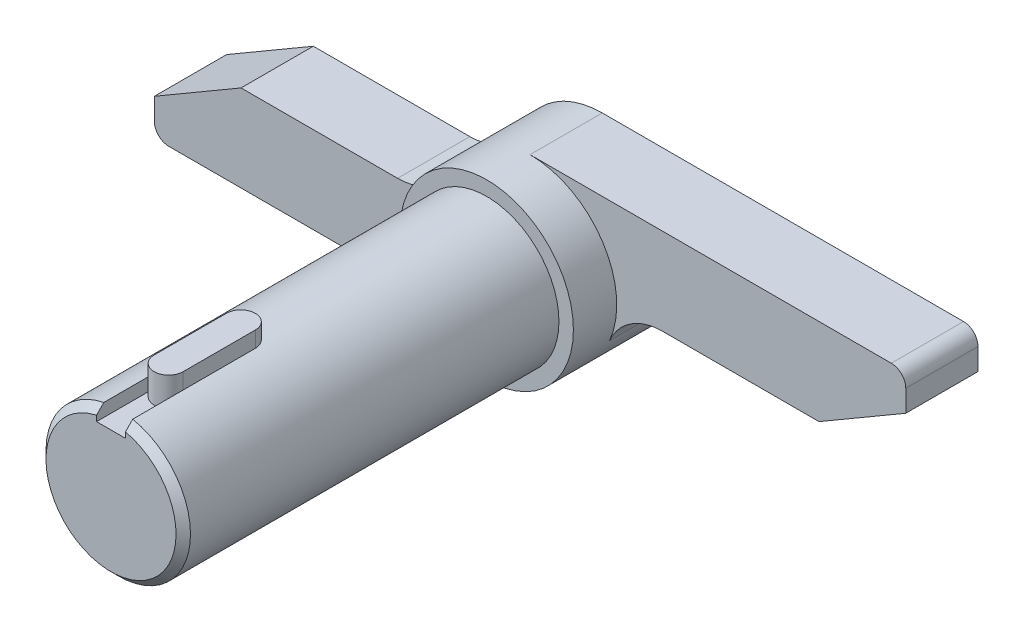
ISO-10303-21;
HEADER;
FILE_DESCRIPTION(('STEP AP214'),'2;1');
FILE_NAME('part.step','',(''),(''),'','','');
FILE_SCHEMA(('AUTOMOTIVE_DESIGN { 1 0 10303 214 1 1 1 1 }'));
ENDSEC;
DATA;
#1=APPLICATION_CONTEXT('core data for automotive mechanical design processes');
#2=APPLICATION_PROTOCOL_DEFINITION('international standard','automotive_design',2000,#1);
#3=PRODUCT_CONTEXT('',#1,'mechanical');
#4=PRODUCT('Part','Part','',(#3));
#5=PRODUCT_RELATED_PRODUCT_CATEGORY('part','',(#4));
#6=PRODUCT_DEFINITION_FORMATION('','',#4);
#7=PRODUCT_DEFINITION_CONTEXT('part definition',#1,'design');
#8=PRODUCT_DEFINITION('design','',#6,#7);
#9=PRODUCT_DEFINITION_SHAPE('','',#8);
#10=(LENGTH_UNIT() NAMED_UNIT(*) SI_UNIT(.MILLI.,.METRE.));
#11=(NAMED_UNIT(*) PLANE_ANGLE_UNIT() SI_UNIT($,.RADIAN.));
#12=(NAMED_UNIT(*) SI_UNIT($,.STERADIAN.) SOLID_ANGLE_UNIT());
#13=UNCERTAINTY_MEASURE_WITH_UNIT(LENGTH_MEASURE(1.E-05),#10,'distance_accuracy_value','');
#14=(GEOMETRIC_REPRESENTATION_CONTEXT(3) GLOBAL_UNCERTAINTY_ASSIGNED_CONTEXT((#13)) GLOBAL_UNIT_ASSIGNED_CONTEXT((#10,
#11,#12)) REPRESENTATION_CONTEXT('',''));
#15=CARTESIAN_POINT('',(0.,0.,0.));
#16=DIRECTION('',(0.,0.,1.));
#17=DIRECTION('',(1.,0.,0.));
#18=AXIS2_PLACEMENT_3D('',#15,#16,#17);
#19=CARTESIAN_POINT('',(1.0013822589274,4.00000000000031,25.));
#20=DIRECTION('',(0.,1.,0.));
#21=DIRECTION('',(-1.,0.,0.));
#22=AXIS2_PLACEMENT_3D('',#19,#20,#21);
#23=PLANE('',#22);
#24=DIRECTION('',(-0.000275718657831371,0.,0.99999996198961));
#25=VECTOR('',#24,1.);
#26=CARTESIAN_POINT('',(1.0013822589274,4.00000000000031,25.));
#27=LINE('',#26,#25);
#28=CARTESIAN_POINT('',(1.0013822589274,4.00000000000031,25.));
#29=VERTEX_POINT('',#28);
#30=CARTESIAN_POINT('',(0.999999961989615,4.00000000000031,30.013432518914));
#31=VERTEX_POINT('',#30);
#32=EDGE_CURVE('E189',#29,#31,#27,.T.);
#33=ORIENTED_EDGE('',*,*,#32,.T.);
#34=CARTESIAN_POINT('',(0.,4.00000000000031,30.0131568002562));
#35=DIRECTION('',(0.,1.,0.));
#36=DIRECTION('',(-1.,0.,0.));
#37=AXIS2_PLACEMENT_3D('',#34,#35,#36);
#38=CIRCLE('',#37,1.);
#39=CARTESIAN_POINT('',(-1.,4.00000000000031,30.0131568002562));
#40=VERTEX_POINT('',#39);
#41=EDGE_CURVE('E201',#40,#31,#38,.T.);
#42=ORIENTED_EDGE('',*,*,#41,.F.);
#43=DIRECTION('',(0.,0.,1.));
#44=VECTOR('',#43,1.);
#45=CARTESIAN_POINT('',(-1.,4.00000000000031,25.));
#46=LINE('',#45,#44);
#47=CARTESIAN_POINT('',(-1.,4.00000000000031,34.));
#48=VERTEX_POINT('',#47);
#49=EDGE_CURVE('E216',#40,#48,#46,.T.);
#50=ORIENTED_EDGE('',*,*,#49,.T.);
#51=DIRECTION('',(-1.,0.,0.));
#52=VECTOR('',#51,1.);
#53=CARTESIAN_POINT('',(1.0013822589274,4.00000000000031,34.));
#54=LINE('',#53,#52);
#55=CARTESIAN_POINT('',(1.0013822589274,4.00000000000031,34.));
#56=VERTEX_POINT('',#55);
#57=EDGE_CURVE('E207',#56,#48,#54,.T.);
#58=ORIENTED_EDGE('',*,*,#57,.F.);
#59=DIRECTION('',(0.,0.,1.));
#60=VECTOR('',#59,1.);
#61=CARTESIAN_POINT('',(1.0013822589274,4.00000000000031,25.));
#62=LINE('',#61,#60);
#63=EDGE_CURVE('E205',#29,#56,#62,.T.);
#64=ORIENTED_EDGE('',*,*,#63,.F.);
#65=EDGE_LOOP('',(#33,#42,#50,#58,#64));
#66=FACE_BOUND('',#65,.T.);
#67=ADVANCED_FACE('F33',(#66),#23,.T.);
#68=CARTESIAN_POINT('',(0.,0.,34.));
#69=DIRECTION('',(0.,0.,-1.));
#70=DIRECTION('',(-1.,0.,0.));
#71=AXIS2_PLACEMENT_3D('',#68,#69,#70);
#72=CYLINDRICAL_SURFACE('',#71,4.99999999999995);
#73=CARTESIAN_POINT('',(0.,0.,8.));
#74=DIRECTION('',(0.,0.,1.));
#75=DIRECTION('',(1.,0.,0.));
#76=AXIS2_PLACEMENT_3D('',#73,#74,#75);
#77=CIRCLE('',#76,4.99999999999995);
#78=CARTESIAN_POINT('',(4.99999999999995,0.,8.));
#79=VERTEX_POINT('',#78);
#80=EDGE_CURVE('E227',#79,#79,#77,.T.);
#81=ORIENTED_EDGE('',*,*,#80,.T.);
#82=EDGE_LOOP('',(#81));
#83=FACE_BOUND('',#82,.T.);
#84=CARTESIAN_POINT('',(1.00002814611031,4.89897374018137,25.007502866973));
#85=CARTESIAN_POINT('',(1.00002609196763,4.89897484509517,24.9519369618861));
#86=CARTESIAN_POINT('',(0.995381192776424,4.89992939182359,24.896345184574));
#87=CARTESIAN_POINT('',(0.976939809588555,4.90363883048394,24.7867342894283));
#88=CARTESIAN_POINT('',(0.96313600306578,4.90639516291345,24.7327164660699));
#89=CARTESIAN_POINT('',(0.926821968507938,4.91338379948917,24.6278551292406));
#90=CARTESIAN_POINT('',(0.904320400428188,4.91761463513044,24.5770085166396));
#91=CARTESIAN_POINT('',(0.851273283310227,4.92707382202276,24.4798135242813));
#92=CARTESIAN_POINT('',(0.820728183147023,4.93230211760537,24.4334648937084));
#93=CARTESIAN_POINT('',(0.75200059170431,4.94324973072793,24.3459236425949));
#94=CARTESIAN_POINT('',(0.713726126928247,4.94897443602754,24.3048038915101));
#95=CARTESIAN_POINT('',(0.630824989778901,4.96022241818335,24.2295237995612));
#96=CARTESIAN_POINT('',(0.586197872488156,4.96574568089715,24.1953639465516));
#97=CARTESIAN_POINT('',(0.491375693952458,4.9760265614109,24.1346905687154));
#98=CARTESIAN_POINT('',(0.441135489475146,4.98077708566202,24.1082462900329));
#99=CARTESIAN_POINT('',(0.336814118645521,4.9889167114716,24.0642015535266));
#100=CARTESIAN_POINT('',(0.282733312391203,4.99230594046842,24.0466002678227));
#101=CARTESIAN_POINT('',(0.173022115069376,4.99730303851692,24.020967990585));
#102=CARTESIAN_POINT('',(0.117421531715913,4.99893379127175,24.0128139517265));
#103=CARTESIAN_POINT('',(0.00561923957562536,5.00030922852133,24.0059237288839));
#104=CARTESIAN_POINT('',(-0.0505824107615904,5.00005409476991,24.007186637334));
#105=CARTESIAN_POINT('',(-0.16114595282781,4.99770423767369,24.0190011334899));
#106=CARTESIAN_POINT('',(-0.215522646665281,4.99563576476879,24.0294201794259));
#107=CARTESIAN_POINT('',(-0.321739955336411,4.98992125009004,24.0590409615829));
#108=CARTESIAN_POINT('',(-0.37358046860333,4.98627514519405,24.0782430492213));
#109=CARTESIAN_POINT('',(-0.473631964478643,4.97777178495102,24.1250076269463));
#110=CARTESIAN_POINT('',(-0.521818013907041,4.97290704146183,24.15262204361));
#111=CARTESIAN_POINT('',(-0.612921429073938,4.96250268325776,24.2153889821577));
#112=CARTESIAN_POINT('',(-0.655838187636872,4.95696299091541,24.2505423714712));
#113=CARTESIAN_POINT('',(-0.735971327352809,4.94570669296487,24.3281164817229));
#114=CARTESIAN_POINT('',(-0.773075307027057,4.93998868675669,24.3706531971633));
#115=CARTESIAN_POINT('',(-0.839641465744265,4.9291118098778,24.4614029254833));
#116=CARTESIAN_POINT('',(-0.869103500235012,4.92395294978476,24.5096160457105));
#117=CARTESIAN_POINT('',(-0.919588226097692,4.9147757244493,24.6105114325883));
#118=CARTESIAN_POINT('',(-0.940592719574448,4.91075982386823,24.6632030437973));
#119=CARTESIAN_POINT('',(-0.97341747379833,4.90435938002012,24.7714664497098));
#120=CARTESIAN_POINT('',(-0.985238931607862,4.90197462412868,24.827037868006));
#121=CARTESIAN_POINT('',(-0.999194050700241,4.89914907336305,24.9384646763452));
#122=CARTESIAN_POINT('',(-1.00149002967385,4.89867571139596,24.9942989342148));
#123=CARTESIAN_POINT('',(-0.996765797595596,4.89963912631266,25.1055526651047));
#124=CARTESIAN_POINT('',(-0.989746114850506,4.90107579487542,25.1609721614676));
#125=CARTESIAN_POINT('',(-0.966729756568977,4.90566689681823,25.2692776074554));
#126=CARTESIAN_POINT('',(-0.950819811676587,4.90880472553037,25.322182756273));
#127=CARTESIAN_POINT('',(-0.910567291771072,4.91643003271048,25.4245765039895));
#128=CARTESIAN_POINT('',(-0.886224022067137,4.9209176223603,25.4740648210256));
#129=CARTESIAN_POINT('',(-0.829428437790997,4.93080997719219,25.5689303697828));
#130=CARTESIAN_POINT('',(-0.796874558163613,4.93622593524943,25.6142456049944));
#131=CARTESIAN_POINT('',(-0.724717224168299,4.94733407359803,25.6988293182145));
#132=CARTESIAN_POINT('',(-0.685113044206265,4.95302628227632,25.7380971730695));
#133=CARTESIAN_POINT('',(-0.599250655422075,4.96415125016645,25.8100868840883));
#134=CARTESIAN_POINT('',(-0.552899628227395,4.96957868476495,25.8426989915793));
#135=CARTESIAN_POINT('',(-0.455282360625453,4.97946996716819,25.8996730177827));
#136=CARTESIAN_POINT('',(-0.40401632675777,4.98393385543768,25.9240352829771));
#137=CARTESIAN_POINT('',(-0.298312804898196,4.99137235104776,25.9636581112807));
#138=CARTESIAN_POINT('',(-0.243895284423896,4.9943553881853,25.9789702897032));
#139=CARTESIAN_POINT('',(-0.133194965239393,4.99853222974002,26.0002218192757));
#140=CARTESIAN_POINT('',(-0.0769123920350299,4.99972624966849,26.006162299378));
#141=CARTESIAN_POINT('',(0.0348720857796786,5.00018542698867,26.0084580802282));
#142=CARTESIAN_POINT('',(0.0903705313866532,4.99948378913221,26.0049783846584));
#143=CARTESIAN_POINT('',(0.199974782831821,4.99630030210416,25.9888969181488));
#144=CARTESIAN_POINT('',(0.254080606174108,4.99381847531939,25.9762952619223));
#145=CARTESIAN_POINT('',(0.359260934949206,4.98735440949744,25.9424009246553));
#146=CARTESIAN_POINT('',(0.410342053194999,4.98337559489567,25.9211280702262));
#147=CARTESIAN_POINT('',(0.508233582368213,4.97434597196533,25.870516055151));
#148=CARTESIAN_POINT('',(0.555043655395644,4.96929507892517,25.8411762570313));
#149=CARTESIAN_POINT('',(0.643880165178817,4.95857389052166,25.7747066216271));
#150=CARTESIAN_POINT('',(0.685817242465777,4.95289491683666,25.7374587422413));
#151=CARTESIAN_POINT('',(0.762902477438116,4.94160917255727,25.6564727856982));
#152=CARTESIAN_POINT('',(0.798049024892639,4.9360024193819,25.6127331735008));
#153=CARTESIAN_POINT('',(0.860915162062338,4.92542942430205,25.5194401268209));
#154=CARTESIAN_POINT('',(0.888550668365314,4.92047073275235,25.4698291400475));
#155=CARTESIAN_POINT('',(0.935049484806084,4.91184753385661,25.3665824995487));
#156=CARTESIAN_POINT('',(0.953920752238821,4.90818185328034,25.3129505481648));
#157=CARTESIAN_POINT('',(0.978696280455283,4.90329139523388,25.217248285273));
#158=CARTESIAN_POINT('',(0.986681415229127,4.90168231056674,25.1757237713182));
#159=CARTESIAN_POINT('',(0.997348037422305,4.89952308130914,25.0919720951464));
#160=CARTESIAN_POINT('',(1.00002970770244,4.89897290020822,25.0497449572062));
#161=CARTESIAN_POINT('',(1.00002814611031,4.89897374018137,25.007502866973));
#162=B_SPLINE_CURVE_WITH_KNOTS('',3,(#84,#85,#86,#87,#88,#89,#90,#91,#92,#93,#94,#95,#96,#97,
#98,#99,#100,#101,#102,#103,#104,#105,#106,#107,#108,#109,#110,#111,#112,#113,#114,#115,#116,
#117,#118,#119,#120,#121,#122,#123,#124,#125,#126,#127,#128,#129,#130,#131,#132,#133,#134,#135,
#136,#137,#138,#139,#140,#141,#142,#143,#144,#145,#146,#147,#148,#149,#150,#151,#152,#153,#154,
#155,#156,#157,#158,#159,#160,#161),.UNSPECIFIED.,.T.,.F.,(4,2,2,2,2,2,2,2,2,2,2,2,2,2,2,2,2,2,
2,2,2,2,2,2,2,2,2,2,2,2,2,2,2,2,2,2,2,2,4),(0.,0.166543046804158,0.333219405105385,
0.499730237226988,0.666231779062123,0.834845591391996,1.00347121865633,1.17356670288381,
1.34364625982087,1.51148475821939,1.67930708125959,1.84473934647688,2.01017823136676,
2.17665975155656,2.34316043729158,2.51256335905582,2.68196948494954,2.85173819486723,
3.02148477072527,3.1883266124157,3.35515899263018,3.52039152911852,3.68563767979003,
3.85303781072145,4.02045517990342,4.19044273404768,4.36042314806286,4.52942451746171,
4.69840552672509,4.86444590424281,5.0304841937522,5.19614494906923,5.36181879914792,
5.53016550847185,5.69855208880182,5.8687525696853,6.03879821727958,6.16541127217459,
6.29201996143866),.UNSPECIFIED.);
#163=CARTESIAN_POINT('',(0.981829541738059,4.90265343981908,24.8175896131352));
#164=VERTEX_POINT('',#163);
#165=CARTESIAN_POINT('',(-1.,4.8989794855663,25.015005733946));
#166=VERTEX_POINT('',#165);
#167=EDGE_CURVE('E452',#164,#166,#162,.T.);
#168=ORIENTED_EDGE('',*,*,#167,.F.);
#169=CARTESIAN_POINT('',(1.00149476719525,4.89867412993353,25.015005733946));
#170=CARTESIAN_POINT('',(1.00149271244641,4.89867523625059,25.0706096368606));
#171=CARTESIAN_POINT('',(0.996844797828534,4.89963185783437,25.1262394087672));
#172=CARTESIAN_POINT('',(0.97839150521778,4.90334940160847,25.2359251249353));
#173=CARTESIAN_POINT('',(0.964578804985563,4.90611176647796,25.2899797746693));
#174=CARTESIAN_POINT('',(0.9282415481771,4.91311585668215,25.3949124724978));
#175=CARTESIAN_POINT('',(0.905725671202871,4.91735610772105,25.4457936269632));
#176=CARTESIAN_POINT('',(0.852645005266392,4.92683672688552,25.5430548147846));
#177=CARTESIAN_POINT('',(0.822080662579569,4.93207703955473,25.5894350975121));
#178=CARTESIAN_POINT('',(0.753308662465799,4.94305073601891,25.6770381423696));
#179=CARTESIAN_POINT('',(0.715008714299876,4.94878954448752,25.7181877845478));
#180=CARTESIAN_POINT('',(0.63205212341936,4.96006644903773,25.7935231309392));
#181=CARTESIAN_POINT('',(0.587395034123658,4.96560453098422,25.8277083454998));
#182=CARTESIAN_POINT('',(0.492506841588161,4.97591507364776,25.888428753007));
#183=CARTESIAN_POINT('',(0.442230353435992,4.98068040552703,25.9148943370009));
#184=CARTESIAN_POINT('',(0.337832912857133,4.98884823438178,25.9589751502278));
#185=CARTESIAN_POINT('',(0.283712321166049,4.99225085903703,25.9765912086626));
#186=CARTESIAN_POINT('',(0.17392047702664,4.99727229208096,26.0022455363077));
#187=CARTESIAN_POINT('',(0.118279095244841,4.99891403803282,26.010407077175));
#188=CARTESIAN_POINT('',(0.00639419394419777,5.00030876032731,26.0173051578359));
#189=CARTESIAN_POINT('',(-0.0498492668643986,5.00006191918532,26.0160426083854));
#190=CARTESIAN_POINT('',(-0.160493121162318,4.99772566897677,26.0042218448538));
#191=CARTESIAN_POINT('',(-0.214908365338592,4.99566262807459,25.9937966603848));
#192=CARTESIAN_POINT('',(-0.321201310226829,4.98995635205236,25.9641574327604));
#193=CARTESIAN_POINT('',(-0.373078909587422,4.98631305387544,25.9449430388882));
#194=CARTESIAN_POINT('',(-0.473201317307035,4.97781309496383,25.8981484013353));
#195=CARTESIAN_POINT('',(-0.521421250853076,4.97294895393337,25.8705163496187));
#196=CARTESIAN_POINT('',(-0.612589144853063,4.9625440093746,25.8077090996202));
#197=CARTESIAN_POINT('',(-0.655536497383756,4.95700312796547,25.7725330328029));
#198=CARTESIAN_POINT('',(-0.735727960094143,4.94574314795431,25.694908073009));
#199=CARTESIAN_POINT('',(-0.772859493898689,4.94002262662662,25.6523429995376));
#200=CARTESIAN_POINT('',(-0.839475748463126,4.92914020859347,25.5615324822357));
#201=CARTESIAN_POINT('',(-0.868960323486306,4.92397832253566,25.5132869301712));
#202=CARTESIAN_POINT('',(-0.919485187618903,4.91479511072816,25.4123221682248));
#203=CARTESIAN_POINT('',(-0.940507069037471,4.91077627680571,25.3595935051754));
#204=CARTESIAN_POINT('',(-0.973360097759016,4.90437081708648,25.2512535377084));
#205=CARTESIAN_POINT('',(-0.985192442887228,4.90198397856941,25.1956426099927));
#206=CARTESIAN_POINT('',(-0.999162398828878,4.89915553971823,25.0841358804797));
#207=CARTESIAN_POINT('',(-1.00146239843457,4.89868135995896,25.0282612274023));
#208=CARTESIAN_POINT('',(-0.996739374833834,4.89964450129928,24.9169266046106));
#209=CARTESIAN_POINT('',(-0.989716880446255,4.90108171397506,24.861466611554));
#210=CARTESIAN_POINT('',(-0.966688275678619,4.90567508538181,24.7530819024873));
#211=CARTESIAN_POINT('',(-0.950769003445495,4.90881461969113,24.700137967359));
#212=CARTESIAN_POINT('',(-0.910491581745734,4.91644410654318,24.5976687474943));
#213=CARTESIAN_POINT('',(-0.886132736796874,4.92093417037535,24.5481437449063));
#214=CARTESIAN_POINT('',(-0.82929991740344,4.93083170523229,24.4532074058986));
#215=CARTESIAN_POINT('',(-0.796724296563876,4.93625037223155,24.4078581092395));
#216=CARTESIAN_POINT('',(-0.724518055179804,4.94736342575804,24.3232103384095));
#217=CARTESIAN_POINT('',(-0.684886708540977,4.95305784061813,24.2839124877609));
#218=CARTESIAN_POINT('',(-0.598965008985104,4.96418598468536,24.2118674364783));
#219=CARTESIAN_POINT('',(-0.5525817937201,4.96961437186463,24.1792300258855));
#220=CARTESIAN_POINT('',(-0.454896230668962,4.97950559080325,24.1222111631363));
#221=CARTESIAN_POINT('',(-0.40359409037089,4.9839684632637,24.0978293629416));
#222=CARTESIAN_POINT('',(-0.297816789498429,4.99140235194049,24.05817435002));
#223=CARTESIAN_POINT('',(-0.243361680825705,4.99438184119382,24.0428493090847));
#224=CARTESIAN_POINT('',(-0.132584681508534,4.99854887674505,24.0215784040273));
#225=CARTESIAN_POINT('',(-0.0762630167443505,4.99973663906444,24.0156314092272));
#226=CARTESIAN_POINT('',(0.0355985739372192,5.00018072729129,24.0133291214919));
#227=CARTESIAN_POINT('',(0.0911350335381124,4.99947032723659,24.0168086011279));
#228=CARTESIAN_POINT('',(0.20081456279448,4.99626703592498,24.0328954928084));
#229=CARTESIAN_POINT('',(0.254957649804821,4.9937741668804,24.0455027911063));
#230=CARTESIAN_POINT('',(0.360211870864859,4.98728622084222,24.0794142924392));
#231=CARTESIAN_POINT('',(0.41132956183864,4.98329454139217,24.1006988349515));
#232=CARTESIAN_POINT('',(0.509291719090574,4.97423810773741,24.1513396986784));
#233=CARTESIAN_POINT('',(0.556135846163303,4.96917326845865,24.1806966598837));
#234=CARTESIAN_POINT('',(0.645039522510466,4.95842353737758,24.247207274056));
#235=CARTESIAN_POINT('',(0.687009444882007,4.952729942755,24.2844793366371));
#236=CARTESIAN_POINT('',(0.764155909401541,4.94141575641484,24.3655189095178));
#237=CARTESIAN_POINT('',(0.799330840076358,4.93579518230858,24.4092879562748));
#238=CARTESIAN_POINT('',(0.862249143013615,4.92519625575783,24.5026453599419));
#239=CARTESIAN_POINT('',(0.889908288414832,4.92022548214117,24.5522913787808));
#240=CARTESIAN_POINT('',(0.936448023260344,4.91158120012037,24.6556120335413));
#241=CARTESIAN_POINT('',(0.955336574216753,4.90790651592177,24.7092829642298));
#242=CARTESIAN_POINT('',(0.980138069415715,4.90300342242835,24.8050633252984));
#243=CARTESIAN_POINT('',(0.988132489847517,4.90139000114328,24.8466266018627));
#244=CARTESIAN_POINT('',(0.998811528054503,4.89922495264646,24.9304568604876));
#245=CARTESIAN_POINT('',(1.00149632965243,4.89867328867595,24.9727238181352));
#246=CARTESIAN_POINT('',(1.00149476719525,4.89867412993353,25.015005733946));
#247=B_SPLINE_CURVE_WITH_KNOTS('',3,(#169,#170,#171,#172,#173,#174,#175,#176,#177,#178,#179,
#180,#181,#182,#183,#184,#185,#186,#187,#188,#189,#190,#191,#192,#193,#194,#195,#196,#197,#198,
#199,#200,#201,#202,#203,#204,#205,#206,#207,#208,#209,#210,#211,#212,#213,#214,#215,#216,#217,
#218,#219,#220,#221,#222,#223,#224,#225,#226,#227,#228,#229,#230,#231,#232,#233,#234,#235,#236,
#237,#238,#239,#240,#241,#242,#243,#244,#245,#246),.UNSPECIFIED.,.T.,.F.,(4,2,2,2,2,2,2,2,2,2,2,
2,2,2,2,2,2,2,2,2,2,2,2,2,2,2,2,2,2,2,2,2,2,2,2,2,2,2,4),(0.,0.166656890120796,
0.333447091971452,0.500071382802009,0.666686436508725,0.835421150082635,1.00416772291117,
1.17439193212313,1.34460018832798,1.51256329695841,1.68051017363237,1.84605822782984,
2.01161288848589,2.17820780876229,2.34482191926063,2.51434291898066,2.68386714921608,
2.85375815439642,3.02362701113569,3.19058985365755,3.35754322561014,3.52289479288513,
3.68825998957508,3.85578082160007,4.02331890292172,4.19342822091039,4.36353036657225,
4.53264941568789,4.70174807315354,4.86790202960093,5.03405391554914,5.19983141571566,
5.36562206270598,5.53409386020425,5.70260556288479,5.87293437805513,6.04310827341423,
6.16984068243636,6.29656870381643),.UNSPECIFIED.);
#248=CARTESIAN_POINT('',(1.0013822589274,4.89869713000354,25.));
#249=VERTEX_POINT('',#248);
#250=EDGE_CURVE('E453',#164,#249,#247,.T.);
#251=ORIENTED_EDGE('',*,*,#250,.T.);
#252=DIRECTION('',(0.,0.,-1.));
#253=VECTOR('',#252,1.);
#254=CARTESIAN_POINT('',(1.0013822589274,4.89869713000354,34.));
#255=LINE('',#254,#253);
#256=CARTESIAN_POINT('',(1.0013822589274,4.89869713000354,33.5));
#257=VERTEX_POINT('',#256);
#258=EDGE_CURVE('E210',#249,#257,#255,.F.);
#259=ORIENTED_EDGE('',*,*,#258,.T.);
#260=CARTESIAN_POINT('',(0.,0.,33.5));
#261=DIRECTION('',(0.,0.,1.));
#262=DIRECTION('',(1.,0.,0.));
#263=AXIS2_PLACEMENT_3D('',#260,#261,#262);
#264=CIRCLE('',#263,4.99999999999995);
#265=CARTESIAN_POINT('',(-1.,4.8989794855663,33.5));
#266=VERTEX_POINT('',#265);
#267=EDGE_CURVE('E747',#257,#266,#264,.F.);
#268=ORIENTED_EDGE('',*,*,#267,.T.);
#269=DIRECTION('',(0.,0.,-1.));
#270=VECTOR('',#269,1.);
#271=CARTESIAN_POINT('',(-1.,4.8989794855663,34.));
#272=LINE('',#271,#270);
#273=CARTESIAN_POINT('',(-1.,4.8989794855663,30.0131568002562));
#274=VERTEX_POINT('',#273);
#275=EDGE_CURVE('E224',#266,#274,#272,.T.);
#276=ORIENTED_EDGE('',*,*,#275,.T.);
#277=DIRECTION('',(0.,0.,-1.));
#278=VECTOR('',#277,1.);
#279=CARTESIAN_POINT('',(-1.,4.8989794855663,34.));
#280=LINE('',#279,#278);
#281=EDGE_CURVE('E498',#166,#274,#280,.F.);
#282=ORIENTED_EDGE('',*,*,#281,.F.);
#283=EDGE_LOOP('',(#168,#251,#259,#268,#276,#282));
#284=FACE_BOUND('',#283,.T.);
#285=ADVANCED_FACE('F418',(#83,#284),#72,.T.);
#286=CARTESIAN_POINT('',(-1.,5.5,25.));
#287=DIRECTION('',(-1.,0.,0.));
#288=DIRECTION('',(0.,-1.,0.));
#289=AXIS2_PLACEMENT_3D('',#286,#287,#288);
#290=PLANE('',#289);
#291=ORIENTED_EDGE('',*,*,#49,.F.);
#292=DIRECTION('',(0.,-1.,0.));
#293=VECTOR('',#292,1.);
#294=CARTESIAN_POINT('',(-1.,6.00000000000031,30.0131568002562));
#295=LINE('',#294,#293);
#296=EDGE_CURVE('E479',#274,#40,#295,.T.);
#297=ORIENTED_EDGE('',*,*,#296,.F.);
#298=ORIENTED_EDGE('',*,*,#275,.F.);
#299=CARTESIAN_POINT('',(-1.,6.02791771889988,32.3896978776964));
#300=CARTESIAN_POINT('',(-1.,5.89619229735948,32.5196463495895));
#301=CARTESIAN_POINT('',(-1.,5.7644111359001,32.6495382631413));
#302=CARTESIAN_POINT('',(-1.,5.50070865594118,32.9091801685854));
#303=CARTESIAN_POINT('',(-1.,5.36878733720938,33.0389301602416));
#304=CARTESIAN_POINT('',(-1.,4.97277751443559,33.4279167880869));
#305=CARTESIAN_POINT('',(-1.,4.70843643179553,33.6868967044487));
#306=CARTESIAN_POINT('',(-1.,4.31110288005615,34.0745310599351));
#307=CARTESIAN_POINT('',(-1.,4.17851967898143,34.2036048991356));
#308=CARTESIAN_POINT('',(-1.,3.91298964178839,34.4613772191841));
#309=CARTESIAN_POINT('',(-1.,3.78004280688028,34.5900757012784));
#310=CARTESIAN_POINT('',(-1.,3.51366435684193,34.846977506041));
#311=CARTESIAN_POINT('',(-1.,3.38023272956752,34.9751808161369));
#312=CARTESIAN_POINT('',(-1.,3.11267443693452,35.2308627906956));
#313=CARTESIAN_POINT('',(-1.,2.97854776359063,35.3583414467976));
#314=CARTESIAN_POINT('',(-1.,2.8439683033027,35.4853431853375));
#315=B_SPLINE_CURVE_WITH_KNOTS('',3,(#299,#300,#301,#302,#303,#304,#305,#306,#307,#308,#309,
#310,#311,#312,#313,#314),.UNSPECIFIED.,.F.,.F.,(4,2,2,2,2,2,2,4),(0.,0.555106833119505,
1.11021458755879,2.22040179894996,2.77550956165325,3.33061547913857,3.88573539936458,
4.44086171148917),.UNSPECIFIED.);
#316=CARTESIAN_POINT('',(-1.,4.387482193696,34.));
#317=VERTEX_POINT('',#316);
#318=EDGE_CURVE('E454',#266,#317,#315,.T.);
#319=ORIENTED_EDGE('',*,*,#318,.T.);
#320=DIRECTION('',(0.,-1.,0.));
#321=VECTOR('',#320,1.);
#322=CARTESIAN_POINT('',(-1.,5.5,34.));
#323=LINE('',#322,#321);
#324=EDGE_CURVE('E481',#317,#48,#323,.T.);
#325=ORIENTED_EDGE('',*,*,#324,.T.);
#326=EDGE_LOOP('',(#291,#297,#298,#319,#325));
#327=FACE_BOUND('',#326,.T.);
#328=ADVANCED_FACE('F424',(#327),#290,.F.);
#329=CARTESIAN_POINT('',(0.,0.,8.));
#330=DIRECTION('',(0.,0.,1.));
#331=DIRECTION('',(1.,0.,0.));
#332=AXIS2_PLACEMENT_3D('',#329,#330,#331);
#333=PLANE('',#332);
#334=CARTESIAN_POINT('',(0.,0.,8.));
#335=DIRECTION('',(0.,0.,1.));
#336=DIRECTION('',(1.,0.,0.));
#337=AXIS2_PLACEMENT_3D('',#334,#335,#336);
#338=CIRCLE('',#337,6.);
#339=CARTESIAN_POINT('',(6.,0.,8.));
#340=VERTEX_POINT('',#339);
#341=EDGE_CURVE('E231',#340,#340,#338,.T.);
#342=ORIENTED_EDGE('',*,*,#341,.T.);
#343=EDGE_LOOP('',(#342));
#344=FACE_BOUND('',#343,.T.);
#345=ORIENTED_EDGE('',*,*,#80,.F.);
#346=EDGE_LOOP('',(#345));
#347=FACE_BOUND('',#346,.T.);
#348=ADVANCED_FACE('F469',(#344,#347),#333,.T.);
#349=CARTESIAN_POINT('',(0.,0.,5.));
#350=DIRECTION('',(0.,0.,1.));
#351=DIRECTION('',(1.,0.,0.));
#352=AXIS2_PLACEMENT_3D('',#349,#350,#351);
#353=PLANE('',#352);
#354=DIRECTION('',(0.,-1.,0.));
#355=VECTOR('',#354,1.);
#356=CARTESIAN_POINT('',(26.,6.,5.));
#357=LINE('',#356,#355);
#358=CARTESIAN_POINT('',(26.,5.,5.));
#359=VERTEX_POINT('',#358);
#360=CARTESIAN_POINT('',(26.,3.5,5.));
#361=VERTEX_POINT('',#360);
#362=EDGE_CURVE('E297',#359,#361,#357,.T.);
#363=ORIENTED_EDGE('',*,*,#362,.F.);
#364=CARTESIAN_POINT('',(25.,5.,5.));
#365=DIRECTION('',(0.,0.,1.));
#366=DIRECTION('',(1.,0.,0.));
#367=AXIS2_PLACEMENT_3D('',#364,#365,#366);
#368=CIRCLE('',#367,1.);
#369=CARTESIAN_POINT('',(25.,6.,5.));
#370=VERTEX_POINT('',#369);
#371=EDGE_CURVE('E306',#359,#370,#368,.T.);
#372=ORIENTED_EDGE('',*,*,#371,.T.);
#373=DIRECTION('',(-1.,0.,0.));
#374=VECTOR('',#373,1.);
#375=CARTESIAN_POINT('',(26.,6.,5.));
#376=LINE('',#375,#374);
#377=CARTESIAN_POINT('',(0.,6.,5.));
#378=VERTEX_POINT('',#377);
#379=EDGE_CURVE('E269',#370,#378,#376,.T.);
#380=ORIENTED_EDGE('',*,*,#379,.T.);
#381=CARTESIAN_POINT('',(0.,0.,5.));
#382=DIRECTION('',(0.,0.,1.));
#383=DIRECTION('',(1.,0.,0.));
#384=AXIS2_PLACEMENT_3D('',#381,#382,#383);
#385=CIRCLE('',#384,6.);
#386=CARTESIAN_POINT('',(5.49909083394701,-2.4,5.));
#387=VERTEX_POINT('',#386);
#388=EDGE_CURVE('E230',#387,#378,#385,.T.);
#389=ORIENTED_EDGE('',*,*,#388,.F.);
#390=CARTESIAN_POINT('',(9.16515138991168,-4.,5.));
#391=DIRECTION('',(0.,0.,1.));
#392=DIRECTION('',(1.,0.,0.));
#393=AXIS2_PLACEMENT_3D('',#390,#391,#392);
#394=CIRCLE('',#393,4.);
#395=CARTESIAN_POINT('',(9.16515138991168,0.,5.));
#396=VERTEX_POINT('',#395);
#397=EDGE_CURVE('E293',#387,#396,#394,.F.);
#398=ORIENTED_EDGE('',*,*,#397,.T.);
#399=DIRECTION('',(1.,0.,0.));
#400=VECTOR('',#399,1.);
#401=CARTESIAN_POINT('',(6.,0.,5.));
#402=LINE('',#401,#400);
#403=CARTESIAN_POINT('',(20.,0.,5.));
#404=VERTEX_POINT('',#403);
#405=EDGE_CURVE('E258',#396,#404,#402,.T.);
#406=ORIENTED_EDGE('',*,*,#405,.T.);
#407=DIRECTION('',(0.863778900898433,0.503871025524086,0.));
#408=VECTOR('',#407,1.);
#409=CARTESIAN_POINT('',(20.,0.,5.));
#410=LINE('',#409,#408);
#411=EDGE_CURVE('E284',#404,#361,#410,.T.);
#412=ORIENTED_EDGE('',*,*,#411,.T.);
#413=EDGE_LOOP('',(#363,#372,#380,#389,#398,#406,#412));
#414=FACE_BOUND('',#413,.T.);
#415=ADVANCED_FACE('F383',(#414),#353,.T.);
#416=CARTESIAN_POINT('',(-26.,-6.,5.));
#417=DIRECTION('',(-1.,0.,0.));
#418=DIRECTION('',(0.,-1.,0.));
#419=AXIS2_PLACEMENT_3D('',#416,#417,#418);
#420=PLANE('',#419);
#421=DIRECTION('',(0.,1.,0.));
#422=VECTOR('',#421,1.);
#423=CARTESIAN_POINT('',(-26.,-6.,0.));
#424=LINE('',#423,#422);
#425=CARTESIAN_POINT('',(-26.,-5.,0.));
#426=VERTEX_POINT('',#425);
#427=CARTESIAN_POINT('',(-26.,-3.5,0.));
#428=VERTEX_POINT('',#427);
#429=EDGE_CURVE('E234',#426,#428,#424,.T.);
#430=ORIENTED_EDGE('',*,*,#429,.F.);
#431=DIRECTION('',(0.,0.,-1.));
#432=VECTOR('',#431,1.);
#433=CARTESIAN_POINT('',(-26.,-5.,5.));
#434=LINE('',#433,#432);
#435=CARTESIAN_POINT('',(-26.,-5.,5.));
#436=VERTEX_POINT('',#435);
#437=EDGE_CURVE('E41',#426,#436,#434,.F.);
#438=ORIENTED_EDGE('',*,*,#437,.T.);
#439=DIRECTION('',(0.,1.,0.));
#440=VECTOR('',#439,1.);
#441=CARTESIAN_POINT('',(-26.,-6.,5.));
#442=LINE('',#441,#440);
#443=CARTESIAN_POINT('',(-26.,-3.5,5.));
#444=VERTEX_POINT('',#443);
#445=EDGE_CURVE('E323',#436,#444,#442,.T.);
#446=ORIENTED_EDGE('',*,*,#445,.T.);
#447=DIRECTION('',(0.,0.,-1.));
#448=VECTOR('',#447,1.);
#449=CARTESIAN_POINT('',(-26.,-3.5,5.));
#450=LINE('',#449,#448);
#451=EDGE_CURVE('E242',#444,#428,#450,.T.);
#452=ORIENTED_EDGE('',*,*,#451,.T.);
#453=EDGE_LOOP('',(#430,#438,#446,#452));
#454=FACE_BOUND('',#453,.T.);
#455=ADVANCED_FACE('F35',(#454),#420,.T.);
#456=CARTESIAN_POINT('',(0.,-6.,5.));
#457=DIRECTION('',(0.,-1.,0.));
#458=DIRECTION('',(1.,0.,0.));
#459=AXIS2_PLACEMENT_3D('',#456,#457,#458);
#460=PLANE('',#459);
#461=DIRECTION('',(-1.,0.,0.));
#462=VECTOR('',#461,1.);
#463=CARTESIAN_POINT('',(0.,-6.,5.));
#464=LINE('',#463,#462);
#465=CARTESIAN_POINT('',(0.,-6.,5.));
#466=VERTEX_POINT('',#465);
#467=CARTESIAN_POINT('',(-25.,-6.,5.));
#468=VERTEX_POINT('',#467);
#469=EDGE_CURVE('E256',#466,#468,#464,.T.);
#470=ORIENTED_EDGE('',*,*,#469,.T.);
#471=DIRECTION('',(0.,0.,-1.));
#472=VECTOR('',#471,1.);
#473=CARTESIAN_POINT('',(-25.,-6.,5.));
#474=LINE('',#473,#472);
#475=CARTESIAN_POINT('',(-25.,-6.,0.));
#476=VERTEX_POINT('',#475);
#477=EDGE_CURVE('E308',#468,#476,#474,.T.);
#478=ORIENTED_EDGE('',*,*,#477,.T.);
#479=DIRECTION('',(-1.,0.,0.));
#480=VECTOR('',#479,1.);
#481=CARTESIAN_POINT('',(0.,-6.,0.));
#482=LINE('',#481,#480);
#483=CARTESIAN_POINT('',(0.,-6.,0.));
#484=VERTEX_POINT('',#483);
#485=EDGE_CURVE('E315',#484,#476,#482,.T.);
#486=ORIENTED_EDGE('',*,*,#485,.F.);
#487=DIRECTION('',(0.,0.,-1.));
#488=VECTOR('',#487,1.);
#489=CARTESIAN_POINT('',(0.,-6.,5.));
#490=LINE('',#489,#488);
#491=EDGE_CURVE('E251',#466,#484,#490,.T.);
#492=ORIENTED_EDGE('',*,*,#491,.F.);
#493=EDGE_LOOP('',(#470,#478,#486,#492));
#494=FACE_BOUND('',#493,.T.);
#495=ADVANCED_FACE('F314',(#494),#460,.T.);
#496=CARTESIAN_POINT('',(0.,0.,5.));
#497=DIRECTION('',(0.,0.,-1.));
#498=DIRECTION('',(-1.,0.,0.));
#499=AXIS2_PLACEMENT_3D('',#496,#497,#498);
#500=CYLINDRICAL_SURFACE('',#499,6.);
#501=CARTESIAN_POINT('',(0.,0.,0.));
#502=DIRECTION('',(0.,0.,1.));
#503=DIRECTION('',(1.,0.,0.));
#504=AXIS2_PLACEMENT_3D('',#501,#502,#503);
#505=CIRCLE('',#504,6.);
#506=CARTESIAN_POINT('',(0.,6.,0.));
#507=VERTEX_POINT('',#506);
#508=CARTESIAN_POINT('',(-5.49909083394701,2.4,0.));
#509=VERTEX_POINT('',#508);
#510=EDGE_CURVE('E354',#507,#509,#505,.T.);
#511=ORIENTED_EDGE('',*,*,#510,.T.);
#512=DIRECTION('',(0.,0.,-1.));
#513=VECTOR('',#512,1.);
#514=CARTESIAN_POINT('',(-5.49909083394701,2.4,5.));
#515=LINE('',#514,#513);
#516=CARTESIAN_POINT('',(-5.49909083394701,2.4,5.));
#517=VERTEX_POINT('',#516);
#518=EDGE_CURVE('E279',#509,#517,#515,.F.);
#519=ORIENTED_EDGE('',*,*,#518,.T.);
#520=EDGE_CURVE('E247',#517,#466,#385,.T.);
#521=ORIENTED_EDGE('',*,*,#520,.T.);
#522=ORIENTED_EDGE('',*,*,#491,.T.);
#523=CARTESIAN_POINT('',(0.,0.,0.));
#524=DIRECTION('',(0.,0.,1.));
#525=DIRECTION('',(1.,0.,0.));
#526=AXIS2_PLACEMENT_3D('',#523,#524,#525);
#527=CIRCLE('',#526,6.);
#528=CARTESIAN_POINT('',(5.49909083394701,-2.4,0.));
#529=VERTEX_POINT('',#528);
#530=EDGE_CURVE('E322',#484,#529,#527,.T.);
#531=ORIENTED_EDGE('',*,*,#530,.T.);
#532=DIRECTION('',(0.,0.,-1.));
#533=VECTOR('',#532,1.);
#534=CARTESIAN_POINT('',(5.49909083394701,-2.4,5.));
#535=LINE('',#534,#533);
#536=EDGE_CURVE('E276',#529,#387,#535,.F.);
#537=ORIENTED_EDGE('',*,*,#536,.T.);
#538=ORIENTED_EDGE('',*,*,#388,.T.);
#539=DIRECTION('',(0.,0.,-1.));
#540=VECTOR('',#539,1.);
#541=CARTESIAN_POINT('',(0.,6.,5.));
#542=LINE('',#541,#540);
#543=EDGE_CURVE('E339',#378,#507,#542,.T.);
#544=ORIENTED_EDGE('',*,*,#543,.T.);
#545=EDGE_LOOP('',(#511,#519,#521,#522,#531,#537,#538,#544));
#546=FACE_BOUND('',#545,.T.);
#547=ORIENTED_EDGE('',*,*,#341,.F.);
#548=EDGE_LOOP('',(#547));
#549=FACE_BOUND('',#548,.T.);
#550=ADVANCED_FACE('F389',(#546,#549),#500,.T.);
#551=CARTESIAN_POINT('',(6.,0.,5.));
#552=DIRECTION('',(0.,1.,0.));
#553=DIRECTION('',(0.,0.,1.));
#554=AXIS2_PLACEMENT_3D('',#551,#552,#553);
#555=PLANE('',#554);
#556=ORIENTED_EDGE('',*,*,#405,.F.);
#557=DIRECTION('',(0.,0.,1.));
#558=VECTOR('',#557,1.);
#559=CARTESIAN_POINT('',(9.16515138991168,0.,0.));
#560=LINE('',#559,#558);
#561=CARTESIAN_POINT('',(9.16515138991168,0.,0.));
#562=VERTEX_POINT('',#561);
#563=EDGE_CURVE('E282',#396,#562,#560,.F.);
#564=ORIENTED_EDGE('',*,*,#563,.T.);
#565=DIRECTION('',(1.,0.,0.));
#566=VECTOR('',#565,1.);
#567=CARTESIAN_POINT('',(6.,0.,0.));
#568=LINE('',#567,#566);
#569=CARTESIAN_POINT('',(20.,0.,0.));
#570=VERTEX_POINT('',#569);
#571=EDGE_CURVE('E326',#562,#570,#568,.T.);
#572=ORIENTED_EDGE('',*,*,#571,.T.);
#573=DIRECTION('',(0.,0.,-1.));
#574=VECTOR('',#573,1.);
#575=CARTESIAN_POINT('',(20.,0.,5.));
#576=LINE('',#575,#574);
#577=EDGE_CURVE('E253',#404,#570,#576,.T.);
#578=ORIENTED_EDGE('',*,*,#577,.F.);
#579=EDGE_LOOP('',(#556,#564,#572,#578));
#580=FACE_BOUND('',#579,.T.);
#581=ADVANCED_FACE('F369',(#580),#555,.F.);
#582=CARTESIAN_POINT('',(20.,0.,5.));
#583=DIRECTION('',(-0.503871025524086,0.863778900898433,0.));
#584=DIRECTION('',(-0.863778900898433,-0.503871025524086,0.));
#585=AXIS2_PLACEMENT_3D('',#582,#583,#584);
#586=PLANE('',#585);
#587=DIRECTION('',(0.863778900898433,0.503871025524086,0.));
#588=VECTOR('',#587,1.);
#589=CARTESIAN_POINT('',(20.,0.,0.));
#590=LINE('',#589,#588);
#591=CARTESIAN_POINT('',(26.,3.5,0.));
#592=VERTEX_POINT('',#591);
#593=EDGE_CURVE('E363',#570,#592,#590,.T.);
#594=ORIENTED_EDGE('',*,*,#593,.T.);
#595=DIRECTION('',(0.,0.,-1.));
#596=VECTOR('',#595,1.);
#597=CARTESIAN_POINT('',(26.,3.5,5.));
#598=LINE('',#597,#596);
#599=EDGE_CURVE('E337',#361,#592,#598,.T.);
#600=ORIENTED_EDGE('',*,*,#599,.F.);
#601=ORIENTED_EDGE('',*,*,#411,.F.);
#602=ORIENTED_EDGE('',*,*,#577,.T.);
#603=EDGE_LOOP('',(#594,#600,#601,#602));
#604=FACE_BOUND('',#603,.T.);
#605=ADVANCED_FACE('F374',(#604),#586,.F.);
#606=CARTESIAN_POINT('',(26.,6.,5.));
#607=DIRECTION('',(1.,0.,0.));
#608=DIRECTION('',(0.,1.,0.));
#609=AXIS2_PLACEMENT_3D('',#606,#607,#608);
#610=PLANE('',#609);
#611=DIRECTION('',(0.,-1.,0.));
#612=VECTOR('',#611,1.);
#613=CARTESIAN_POINT('',(26.,6.,0.));
#614=LINE('',#613,#612);
#615=CARTESIAN_POINT('',(26.,5.,0.));
#616=VERTEX_POINT('',#615);
#617=EDGE_CURVE('E361',#616,#592,#614,.T.);
#618=ORIENTED_EDGE('',*,*,#617,.F.);
#619=DIRECTION('',(0.,0.,-1.));
#620=VECTOR('',#619,1.);
#621=CARTESIAN_POINT('',(26.,5.,5.));
#622=LINE('',#621,#620);
#623=EDGE_CURVE('E304',#616,#359,#622,.F.);
#624=ORIENTED_EDGE('',*,*,#623,.T.);
#625=ORIENTED_EDGE('',*,*,#362,.T.);
#626=ORIENTED_EDGE('',*,*,#599,.T.);
#627=EDGE_LOOP('',(#618,#624,#625,#626));
#628=FACE_BOUND('',#627,.T.);
#629=ADVANCED_FACE('F379',(#628),#610,.T.);
#630=CARTESIAN_POINT('',(26.,6.,5.));
#631=DIRECTION('',(0.,-1.,0.));
#632=DIRECTION('',(1.,0.,0.));
#633=AXIS2_PLACEMENT_3D('',#630,#631,#632);
#634=PLANE('',#633);
#635=ORIENTED_EDGE('',*,*,#379,.F.);
#636=DIRECTION('',(0.,0.,-1.));
#637=VECTOR('',#636,1.);
#638=CARTESIAN_POINT('',(25.,6.,0.));
#639=LINE('',#638,#637);
#640=CARTESIAN_POINT('',(25.,6.,0.));
#641=VERTEX_POINT('',#640);
#642=EDGE_CURVE('E295',#370,#641,#639,.T.);
#643=ORIENTED_EDGE('',*,*,#642,.T.);
#644=DIRECTION('',(-1.,0.,0.));
#645=VECTOR('',#644,1.);
#646=CARTESIAN_POINT('',(26.,6.,0.));
#647=LINE('',#646,#645);
#648=EDGE_CURVE('E359',#641,#507,#647,.T.);
#649=ORIENTED_EDGE('',*,*,#648,.T.);
#650=ORIENTED_EDGE('',*,*,#543,.F.);
#651=EDGE_LOOP('',(#635,#643,#649,#650));
#652=FACE_BOUND('',#651,.T.);
#653=ADVANCED_FACE('F404',(#652),#634,.F.);
#654=CARTESIAN_POINT('',(-6.,0.,5.));
#655=DIRECTION('',(0.,-1.,0.));
#656=DIRECTION('',(0.,0.,-1.));
#657=AXIS2_PLACEMENT_3D('',#654,#655,#656);
#658=PLANE('',#657);
#659=DIRECTION('',(-1.,0.,0.));
#660=VECTOR('',#659,1.);
#661=CARTESIAN_POINT('',(-6.,0.,5.));
#662=LINE('',#661,#660);
#663=CARTESIAN_POINT('',(-9.16515138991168,0.,5.));
#664=VERTEX_POINT('',#663);
#665=CARTESIAN_POINT('',(-20.,0.,5.));
#666=VERTEX_POINT('',#665);
#667=EDGE_CURVE('E266',#664,#666,#662,.T.);
#668=ORIENTED_EDGE('',*,*,#667,.F.);
#669=DIRECTION('',(0.,0.,1.));
#670=VECTOR('',#669,1.);
#671=CARTESIAN_POINT('',(-9.16515138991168,0.,0.));
#672=LINE('',#671,#670);
#673=CARTESIAN_POINT('',(-9.16515138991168,0.,0.));
#674=VERTEX_POINT('',#673);
#675=EDGE_CURVE('E273',#664,#674,#672,.F.);
#676=ORIENTED_EDGE('',*,*,#675,.T.);
#677=DIRECTION('',(-1.,0.,0.));
#678=VECTOR('',#677,1.);
#679=CARTESIAN_POINT('',(-6.,0.,0.));
#680=LINE('',#679,#678);
#681=CARTESIAN_POINT('',(-20.,0.,0.));
#682=VERTEX_POINT('',#681);
#683=EDGE_CURVE('E353',#674,#682,#680,.T.);
#684=ORIENTED_EDGE('',*,*,#683,.T.);
#685=DIRECTION('',(0.,0.,-1.));
#686=VECTOR('',#685,1.);
#687=CARTESIAN_POINT('',(-20.,0.,5.));
#688=LINE('',#687,#686);
#689=EDGE_CURVE('E340',#666,#682,#688,.T.);
#690=ORIENTED_EDGE('',*,*,#689,.F.);
#691=EDGE_LOOP('',(#668,#676,#684,#690));
#692=FACE_BOUND('',#691,.T.);
#693=ADVANCED_FACE('F400',(#692),#658,.F.);
#694=CARTESIAN_POINT('',(-20.,0.,5.));
#695=DIRECTION('',(0.503871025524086,-0.863778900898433,0.));
#696=DIRECTION('',(0.863778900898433,0.503871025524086,0.));
#697=AXIS2_PLACEMENT_3D('',#694,#695,#696);
#698=PLANE('',#697);
#699=DIRECTION('',(-0.863778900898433,-0.503871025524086,0.));
#700=VECTOR('',#699,1.);
#701=CARTESIAN_POINT('',(-20.,0.,0.));
#702=LINE('',#701,#700);
#703=EDGE_CURVE('E350',#682,#428,#702,.T.);
#704=ORIENTED_EDGE('',*,*,#703,.T.);
#705=ORIENTED_EDGE('',*,*,#451,.F.);
#706=DIRECTION('',(-0.863778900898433,-0.503871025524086,0.));
#707=VECTOR('',#706,1.);
#708=CARTESIAN_POINT('',(-20.,0.,5.));
#709=LINE('',#708,#707);
#710=EDGE_CURVE('E270',#666,#444,#709,.T.);
#711=ORIENTED_EDGE('',*,*,#710,.F.);
#712=ORIENTED_EDGE('',*,*,#689,.T.);
#713=EDGE_LOOP('',(#704,#705,#711,#712));
#714=FACE_BOUND('',#713,.T.);
#715=ADVANCED_FACE('F351',(#714),#698,.F.);
#716=ORIENTED_EDGE('',*,*,#445,.F.);
#717=CARTESIAN_POINT('',(-25.,-5.,5.));
#718=DIRECTION('',(0.,0.,1.));
#719=DIRECTION('',(1.,0.,0.));
#720=AXIS2_PLACEMENT_3D('',#717,#718,#719);
#721=CIRCLE('',#720,1.);
#722=EDGE_CURVE('E11',#436,#468,#721,.T.);
#723=ORIENTED_EDGE('',*,*,#722,.T.);
#724=ORIENTED_EDGE('',*,*,#469,.F.);
#725=ORIENTED_EDGE('',*,*,#520,.F.);
#726=CARTESIAN_POINT('',(-9.16515138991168,4.,5.));
#727=DIRECTION('',(0.,0.,1.));
#728=DIRECTION('',(1.,0.,0.));
#729=AXIS2_PLACEMENT_3D('',#726,#727,#728);
#730=CIRCLE('',#729,4.);
#731=EDGE_CURVE('E289',#517,#664,#730,.F.);
#732=ORIENTED_EDGE('',*,*,#731,.T.);
#733=ORIENTED_EDGE('',*,*,#667,.T.);
#734=ORIENTED_EDGE('',*,*,#710,.T.);
#735=EDGE_LOOP('',(#716,#723,#724,#725,#732,#733,#734));
#736=FACE_BOUND('',#735,.T.);
#737=ADVANCED_FACE('F391',(#736),#353,.T.);
#738=CARTESIAN_POINT('',(0.,0.,0.));
#739=DIRECTION('',(0.,0.,1.));
#740=DIRECTION('',(1.,0.,0.));
#741=AXIS2_PLACEMENT_3D('',#738,#739,#740);
#742=PLANE('',#741);
#743=ORIENTED_EDGE('',*,*,#648,.F.);
#744=CARTESIAN_POINT('',(25.,5.,0.));
#745=DIRECTION('',(0.,0.,1.));
#746=DIRECTION('',(1.,0.,0.));
#747=AXIS2_PLACEMENT_3D('',#744,#745,#746);
#748=CIRCLE('',#747,1.);
#749=EDGE_CURVE('E302',#641,#616,#748,.F.);
#750=ORIENTED_EDGE('',*,*,#749,.T.);
#751=ORIENTED_EDGE('',*,*,#617,.T.);
#752=ORIENTED_EDGE('',*,*,#593,.F.);
#753=ORIENTED_EDGE('',*,*,#571,.F.);
#754=CARTESIAN_POINT('',(9.16515138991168,-4.,0.));
#755=DIRECTION('',(0.,0.,1.));
#756=DIRECTION('',(1.,0.,0.));
#757=AXIS2_PLACEMENT_3D('',#754,#755,#756);
#758=CIRCLE('',#757,4.);
#759=EDGE_CURVE('E291',#562,#529,#758,.T.);
#760=ORIENTED_EDGE('',*,*,#759,.T.);
#761=ORIENTED_EDGE('',*,*,#530,.F.);
#762=ORIENTED_EDGE('',*,*,#485,.T.);
#763=CARTESIAN_POINT('',(-25.,-5.,0.));
#764=DIRECTION('',(0.,0.,1.));
#765=DIRECTION('',(1.,0.,0.));
#766=AXIS2_PLACEMENT_3D('',#763,#764,#765);
#767=CIRCLE('',#766,1.);
#768=EDGE_CURVE('E300',#476,#426,#767,.F.);
#769=ORIENTED_EDGE('',*,*,#768,.T.);
#770=ORIENTED_EDGE('',*,*,#429,.T.);
#771=ORIENTED_EDGE('',*,*,#703,.F.);
#772=ORIENTED_EDGE('',*,*,#683,.F.);
#773=CARTESIAN_POINT('',(-9.16515138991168,4.,0.));
#774=DIRECTION('',(0.,0.,1.));
#775=DIRECTION('',(1.,0.,0.));
#776=AXIS2_PLACEMENT_3D('',#773,#774,#775);
#777=CIRCLE('',#776,4.);
#778=EDGE_CURVE('E287',#674,#509,#777,.T.);
#779=ORIENTED_EDGE('',*,*,#778,.T.);
#780=ORIENTED_EDGE('',*,*,#510,.F.);
#781=EDGE_LOOP('',(#743,#750,#751,#752,#753,#760,#761,#762,#769,#770,#771,#772,#779,#780));
#782=FACE_BOUND('',#781,.T.);
#783=ADVANCED_FACE('F320',(#782),#742,.F.);
#784=CARTESIAN_POINT('',(0.,0.,34.));
#785=DIRECTION('',(0.,0.,1.));
#786=DIRECTION('',(1.,0.,0.));
#787=AXIS2_PLACEMENT_3D('',#784,#785,#786);
#788=PLANE('',#787);
#789=ORIENTED_EDGE('',*,*,#324,.F.);
#790=CARTESIAN_POINT('',(0.,0.,34.));
#791=DIRECTION('',(0.,0.,1.));
#792=DIRECTION('',(1.,0.,0.));
#793=AXIS2_PLACEMENT_3D('',#790,#791,#792);
#794=CIRCLE('',#793,4.49999999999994);
#795=CARTESIAN_POINT('',(1.0013822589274,4.38716691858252,34.));
#796=VERTEX_POINT('',#795);
#797=EDGE_CURVE('E250',#317,#796,#794,.T.);
#798=ORIENTED_EDGE('',*,*,#797,.T.);
#799=DIRECTION('',(0.,1.,0.));
#800=VECTOR('',#799,1.);
#801=CARTESIAN_POINT('',(1.0013822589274,4.00000000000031,34.));
#802=LINE('',#801,#800);
#803=EDGE_CURVE('E217',#56,#796,#802,.T.);
#804=ORIENTED_EDGE('',*,*,#803,.F.);
#805=ORIENTED_EDGE('',*,*,#57,.T.);
#806=EDGE_LOOP('',(#789,#798,#804,#805));
#807=FACE_BOUND('',#806,.T.);
#808=ADVANCED_FACE('F701',(#807),#788,.T.);
#809=CARTESIAN_POINT('',(0.,0.,34.));
#810=DIRECTION('',(0.,0.,-1.));
#811=DIRECTION('',(-1.,0.,0.));
#812=AXIS2_PLACEMENT_3D('',#809,#810,#811);
#813=CONICAL_SURFACE('',#812,4.49999999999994,0.785398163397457);
#814=ORIENTED_EDGE('',*,*,#318,.F.);
#815=ORIENTED_EDGE('',*,*,#267,.F.);
#816=CARTESIAN_POINT('',(1.0013822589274,2.84373318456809,35.4851061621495));
#817=CARTESIAN_POINT('',(1.0013822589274,2.97832285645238,35.3581151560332));
#818=CARTESIAN_POINT('',(1.0013822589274,3.1124585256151,35.2306458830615));
#819=CARTESIAN_POINT('',(1.0013822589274,3.38003293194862,34.9749806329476));
#820=CARTESIAN_POINT('',(1.0013822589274,3.5134716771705,34.8467846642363));
#821=CARTESIAN_POINT('',(1.0013822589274,3.77986303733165,34.5898961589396));
#822=CARTESIAN_POINT('',(1.0013822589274,3.91281566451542,34.4612036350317));
#823=CARTESIAN_POINT('',(1.0013822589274,4.1783562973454,34.2034421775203));
#824=CARTESIAN_POINT('',(1.0013822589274,4.3109443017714,34.0743732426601));
#825=CARTESIAN_POINT('',(1.0013822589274,4.70829110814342,33.6867524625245));
#826=CARTESIAN_POINT('',(1.0013822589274,4.97263952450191,33.4277800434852));
#827=CARTESIAN_POINT('',(1.0013822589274,5.36865898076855,33.0388032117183));
#828=CARTESIAN_POINT('',(1.0013822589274,5.5005832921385,32.9090562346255));
#829=CARTESIAN_POINT('',(1.0013822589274,5.76429137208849,32.6494199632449));
#830=CARTESIAN_POINT('',(1.0013822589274,5.8960751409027,32.5195306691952));
#831=CARTESIAN_POINT('',(1.0013822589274,6.02780301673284,32.3895846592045));
#832=B_SPLINE_CURVE_WITH_KNOTS('',3,(#816,#817,#818,#819,#820,#821,#822,#823,#824,#825,#826,
#827,#828,#829,#830,#831),.UNSPECIFIED.,.F.,.F.,(4,2,2,2,2,2,2,4),(0.,0.555126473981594,
1.11024652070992,1.66535248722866,2.22046030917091,3.33064748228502,3.88575529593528,
4.44086218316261),.UNSPECIFIED.);
#833=EDGE_CURVE('E460',#796,#257,#832,.T.);
#834=ORIENTED_EDGE('',*,*,#833,.F.);
#835=ORIENTED_EDGE('',*,*,#797,.F.);
#836=EDGE_LOOP('',(#814,#815,#834,#835));
#837=FACE_BOUND('',#836,.T.);
#838=ADVANCED_FACE('F439',(#837),#813,.T.);
#839=CARTESIAN_POINT('',(1.0013822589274,4.00000000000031,25.));
#840=DIRECTION('',(1.,0.,0.));
#841=DIRECTION('',(0.,1.,0.));
#842=AXIS2_PLACEMENT_3D('',#839,#840,#841);
#843=PLANE('',#842);
#844=DIRECTION('',(0.,1.,0.));
#845=VECTOR('',#844,1.);
#846=CARTESIAN_POINT('',(1.0013822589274,4.00000000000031,25.));
#847=LINE('',#846,#845);
#848=EDGE_CURVE('E193',#29,#249,#847,.T.);
#849=ORIENTED_EDGE('',*,*,#848,.F.);
#850=ORIENTED_EDGE('',*,*,#63,.T.);
#851=ORIENTED_EDGE('',*,*,#803,.T.);
#852=ORIENTED_EDGE('',*,*,#833,.T.);
#853=ORIENTED_EDGE('',*,*,#258,.F.);
#854=EDGE_LOOP('',(#849,#850,#851,#852,#853));
#855=FACE_BOUND('',#854,.T.);
#856=ADVANCED_FACE('F214',(#855),#843,.F.);
#857=CARTESIAN_POINT('',(0.000747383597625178,4.00000000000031,25.015005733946));
#858=DIRECTION('',(0.,-1.,0.));
#859=DIRECTION('',(1.,0.,0.));
#860=AXIS2_PLACEMENT_3D('',#857,#858,#859);
#861=CIRCLE('',#860,1.00074738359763);
#862=CARTESIAN_POINT('',(-1.,4.00000000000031,25.0150057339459));
#863=VERTEX_POINT('',#862);
#864=CARTESIAN_POINT('',(0.981829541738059,4.00000000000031,24.8175896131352));
#865=VERTEX_POINT('',#864);
#866=EDGE_CURVE('E202',#863,#865,#861,.T.);
#867=ORIENTED_EDGE('',*,*,#866,.T.);
#868=CARTESIAN_POINT('',(0.,4.00000000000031,25.007502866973));
#869=DIRECTION('',(0.,1.,0.));
#870=DIRECTION('',(-1.,0.,0.));
#871=AXIS2_PLACEMENT_3D('',#868,#869,#870);
#872=CIRCLE('',#871,1.00002814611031);
#873=EDGE_CURVE('E211',#865,#863,#872,.T.);
#874=ORIENTED_EDGE('',*,*,#873,.T.);
#875=EDGE_LOOP('',(#867,#874));
#876=FACE_BOUND('',#875,.T.);
#877=ADVANCED_FACE('F420',(#876),#23,.T.);
#878=CARTESIAN_POINT('',(0.,7.00000000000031,25.007502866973));
#879=DIRECTION('',(0.,-1.,0.));
#880=DIRECTION('',(1.,0.,0.));
#881=AXIS2_PLACEMENT_3D('',#878,#879,#880);
#882=CYLINDRICAL_SURFACE('',#881,1.00002814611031);
#883=DIRECTION('',(0.,-1.,0.));
#884=VECTOR('',#883,1.);
#885=CARTESIAN_POINT('',(0.981829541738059,4.50000000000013,24.8175896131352));
#886=LINE('',#885,#884);
#887=EDGE_CURVE('E271',#164,#865,#886,.T.);
#888=ORIENTED_EDGE('',*,*,#887,.F.);
#889=ORIENTED_EDGE('',*,*,#167,.T.);
#890=DIRECTION('',(0.,-1.,0.));
#891=VECTOR('',#890,1.);
#892=CARTESIAN_POINT('',(-1.,7.00000000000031,25.0150057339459));
#893=LINE('',#892,#891);
#894=EDGE_CURVE('E449',#166,#863,#893,.T.);
#895=ORIENTED_EDGE('',*,*,#894,.T.);
#896=ORIENTED_EDGE('',*,*,#873,.F.);
#897=EDGE_LOOP('',(#888,#889,#895,#896));
#898=FACE_BOUND('',#897,.T.);
#899=ADVANCED_FACE('F430',(#898),#882,.F.);
#900=CARTESIAN_POINT('',(0.000747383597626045,6.00000000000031,25.015005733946));
#901=DIRECTION('',(0.,-1.,0.));
#902=DIRECTION('',(1.,0.,0.));
#903=AXIS2_PLACEMENT_3D('',#900,#901,#902);
#904=CYLINDRICAL_SURFACE('',#903,1.00074738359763);
#905=ORIENTED_EDGE('',*,*,#250,.F.);
#906=ORIENTED_EDGE('',*,*,#887,.T.);
#907=ORIENTED_EDGE('',*,*,#866,.F.);
#908=ORIENTED_EDGE('',*,*,#894,.F.);
#909=DIRECTION('',(0.,-1.,0.));
#910=VECTOR('',#909,1.);
#911=CARTESIAN_POINT('',(-0.999999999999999,6.00000000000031,25.015005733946));
#912=LINE('',#911,#910);
#913=CARTESIAN_POINT('',(-0.999999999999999,6.00000000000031,25.015005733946));
#914=VERTEX_POINT('',#913);
#915=EDGE_CURVE('E495',#914,#166,#912,.T.);
#916=ORIENTED_EDGE('',*,*,#915,.F.);
#917=CARTESIAN_POINT('',(0.000747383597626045,6.00000000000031,25.015005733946));
#918=DIRECTION('',(0.,-1.,0.));
#919=DIRECTION('',(1.,0.,0.));
#920=AXIS2_PLACEMENT_3D('',#917,#918,#919);
#921=CIRCLE('',#920,1.00074738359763);
#922=CARTESIAN_POINT('',(1.0013822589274,6.00000000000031,25.));
#923=VERTEX_POINT('',#922);
#924=EDGE_CURVE('E483',#914,#923,#921,.T.);
#925=ORIENTED_EDGE('',*,*,#924,.T.);
#926=DIRECTION('',(0.,-1.,0.));
#927=VECTOR('',#926,1.);
#928=CARTESIAN_POINT('',(1.0013822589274,6.00000000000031,25.));
#929=LINE('',#928,#927);
#930=EDGE_CURVE('E494',#923,#249,#929,.T.);
#931=ORIENTED_EDGE('',*,*,#930,.T.);
#932=EDGE_LOOP('',(#905,#906,#907,#908,#916,#925,#931));
#933=FACE_BOUND('',#932,.T.);
#934=ADVANCED_FACE('F436',(#933),#904,.T.);
#935=CARTESIAN_POINT('',(-0.999999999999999,6.00000000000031,25.015005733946));
#936=DIRECTION('',(1.,0.,0.));
#937=DIRECTION('',(0.,1.,0.));
#938=AXIS2_PLACEMENT_3D('',#935,#936,#937);
#939=PLANE('',#938);
#940=ORIENTED_EDGE('',*,*,#915,.T.);
#941=ORIENTED_EDGE('',*,*,#281,.T.);
#942=CARTESIAN_POINT('',(-1.,6.00000000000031,30.0131568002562));
#943=VERTEX_POINT('',#942);
#944=EDGE_CURVE('E499',#943,#274,#295,.T.);
#945=ORIENTED_EDGE('',*,*,#944,.F.);
#946=DIRECTION('',(0.,0.,1.));
#947=VECTOR('',#946,1.);
#948=CARTESIAN_POINT('',(-0.999999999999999,6.00000000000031,25.015005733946));
#949=LINE('',#948,#947);
#950=EDGE_CURVE('E492',#914,#943,#949,.T.);
#951=ORIENTED_EDGE('',*,*,#950,.F.);
#952=EDGE_LOOP('',(#940,#941,#945,#951));
#953=FACE_BOUND('',#952,.T.);
#954=ADVANCED_FACE('F517',(#953),#939,.F.);
#955=CARTESIAN_POINT('',(0.,6.00000000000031,30.0131568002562));
#956=DIRECTION('',(0.,-1.,0.));
#957=DIRECTION('',(1.,0.,0.));
#958=AXIS2_PLACEMENT_3D('',#955,#956,#957);
#959=CYLINDRICAL_SURFACE('',#958,1.);
#960=ORIENTED_EDGE('',*,*,#41,.T.);
#961=DIRECTION('',(0.,-1.,0.));
#962=VECTOR('',#961,1.);
#963=CARTESIAN_POINT('',(0.999999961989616,6.00000000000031,30.013432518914));
#964=LINE('',#963,#962);
#965=CARTESIAN_POINT('',(0.999999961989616,6.00000000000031,30.013432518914));
#966=VERTEX_POINT('',#965);
#967=EDGE_CURVE('E197',#966,#31,#964,.T.);
#968=ORIENTED_EDGE('',*,*,#967,.F.);
#969=CARTESIAN_POINT('',(0.,6.00000000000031,30.0131568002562));
#970=DIRECTION('',(0.,1.,0.));
#971=DIRECTION('',(-1.,0.,0.));
#972=AXIS2_PLACEMENT_3D('',#969,#970,#971);
#973=CIRCLE('',#972,1.);
#974=EDGE_CURVE('E490',#943,#966,#973,.T.);
#975=ORIENTED_EDGE('',*,*,#974,.F.);
#976=ORIENTED_EDGE('',*,*,#944,.T.);
#977=ORIENTED_EDGE('',*,*,#296,.T.);
#978=EDGE_LOOP('',(#960,#968,#975,#976,#977));
#979=FACE_BOUND('',#978,.T.);
#980=ADVANCED_FACE('F523',(#979),#959,.T.);
#981=CARTESIAN_POINT('',(1.0013822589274,6.00000000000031,25.));
#982=DIRECTION('',(0.99999996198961,0.,0.000275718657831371));
#983=DIRECTION('',(0.000275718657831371,0.,-0.99999996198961));
#984=AXIS2_PLACEMENT_3D('',#981,#982,#983);
#985=PLANE('',#984);
#986=ORIENTED_EDGE('',*,*,#32,.F.);
#987=ORIENTED_EDGE('',*,*,#848,.T.);
#988=ORIENTED_EDGE('',*,*,#930,.F.);
#989=DIRECTION('',(-0.000275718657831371,0.,0.99999996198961));
#990=VECTOR('',#989,1.);
#991=CARTESIAN_POINT('',(1.0013822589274,6.00000000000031,25.));
#992=LINE('',#991,#990);
#993=EDGE_CURVE('E486',#923,#966,#992,.T.);
#994=ORIENTED_EDGE('',*,*,#993,.T.);
#995=ORIENTED_EDGE('',*,*,#967,.T.);
#996=EDGE_LOOP('',(#986,#987,#988,#994,#995));
#997=FACE_BOUND('',#996,.T.);
#998=ADVANCED_FACE('F191',(#997),#985,.T.);
#999=CARTESIAN_POINT('',(0.000747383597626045,6.00000000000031,25.015005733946));
#1000=DIRECTION('',(0.,-1.,0.));
#1001=DIRECTION('',(1.,0.,0.));
#1002=AXIS2_PLACEMENT_3D('',#999,#1000,#1001);
#1003=PLANE('',#1002);
#1004=ORIENTED_EDGE('',*,*,#924,.F.);
#1005=ORIENTED_EDGE('',*,*,#950,.T.);
#1006=ORIENTED_EDGE('',*,*,#974,.T.);
#1007=ORIENTED_EDGE('',*,*,#993,.F.);
#1008=EDGE_LOOP('',(#1004,#1005,#1006,#1007));
#1009=FACE_BOUND('',#1008,.T.);
#1010=ADVANCED_FACE('F522',(#1009),#1003,.F.);
#1011=CARTESIAN_POINT('',(-9.16515138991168,4.,5.));
#1012=DIRECTION('',(0.,0.,-1.));
#1013=DIRECTION('',(-1.,0.,0.));
#1014=AXIS2_PLACEMENT_3D('',#1011,#1012,#1013);
#1015=CYLINDRICAL_SURFACE('',#1014,4.);
#1016=ORIENTED_EDGE('',*,*,#731,.F.);
#1017=ORIENTED_EDGE('',*,*,#518,.F.);
#1018=ORIENTED_EDGE('',*,*,#778,.F.);
#1019=ORIENTED_EDGE('',*,*,#675,.F.);
#1020=EDGE_LOOP('',(#1016,#1017,#1018,#1019));
#1021=FACE_BOUND('',#1020,.T.);
#1022=ADVANCED_FACE('F398',(#1021),#1015,.F.);
#1023=CARTESIAN_POINT('',(9.16515138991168,-4.,5.));
#1024=DIRECTION('',(0.,0.,-1.));
#1025=DIRECTION('',(-1.,0.,0.));
#1026=AXIS2_PLACEMENT_3D('',#1023,#1024,#1025);
#1027=CYLINDRICAL_SURFACE('',#1026,4.);
#1028=ORIENTED_EDGE('',*,*,#397,.F.);
#1029=ORIENTED_EDGE('',*,*,#536,.F.);
#1030=ORIENTED_EDGE('',*,*,#759,.F.);
#1031=ORIENTED_EDGE('',*,*,#563,.F.);
#1032=EDGE_LOOP('',(#1028,#1029,#1030,#1031));
#1033=FACE_BOUND('',#1032,.T.);
#1034=ADVANCED_FACE('F386',(#1033),#1027,.F.);
#1035=CARTESIAN_POINT('',(25.,5.,5.));
#1036=DIRECTION('',(0.,0.,1.));
#1037=DIRECTION('',(1.,0.,0.));
#1038=AXIS2_PLACEMENT_3D('',#1035,#1036,#1037);
#1039=CYLINDRICAL_SURFACE('',#1038,1.);
#1040=ORIENTED_EDGE('',*,*,#371,.F.);
#1041=ORIENTED_EDGE('',*,*,#623,.F.);
#1042=ORIENTED_EDGE('',*,*,#749,.F.);
#1043=ORIENTED_EDGE('',*,*,#642,.F.);
#1044=EDGE_LOOP('',(#1040,#1041,#1042,#1043));
#1045=FACE_BOUND('',#1044,.T.);
#1046=ADVANCED_FACE('F407',(#1045),#1039,.T.);
#1047=CARTESIAN_POINT('',(-25.,-5.,5.));
#1048=DIRECTION('',(0.,0.,-1.));
#1049=DIRECTION('',(-1.,0.,0.));
#1050=AXIS2_PLACEMENT_3D('',#1047,#1048,#1049);
#1051=CYLINDRICAL_SURFACE('',#1050,1.);
#1052=ORIENTED_EDGE('',*,*,#722,.F.);
#1053=ORIENTED_EDGE('',*,*,#437,.F.);
#1054=ORIENTED_EDGE('',*,*,#768,.F.);
#1055=ORIENTED_EDGE('',*,*,#477,.F.);
#1056=EDGE_LOOP('',(#1052,#1053,#1054,#1055));
#1057=FACE_BOUND('',#1056,.T.);
#1058=ADVANCED_FACE('F409',(#1057),#1051,.T.);
#1059=CLOSED_SHELL('',(#67,#285,#328,#348,#415,#455,#495,#550,#581,#605,#629,#653,#693,#715,
#737,#783,#808,#838,#856,#877,#899,#934,#954,#980,#998,#1010,#1022,#1034,#1046,#1058));
#1060=MANIFOLD_SOLID_BREP('B2',#1059);
#1061=ADVANCED_BREP_SHAPE_REPRESENTATION('',(#18,#1060),#14);
#1062=SHAPE_DEFINITION_REPRESENTATION(#9,#1061);
ENDSEC;
END-ISO-10303-21;
